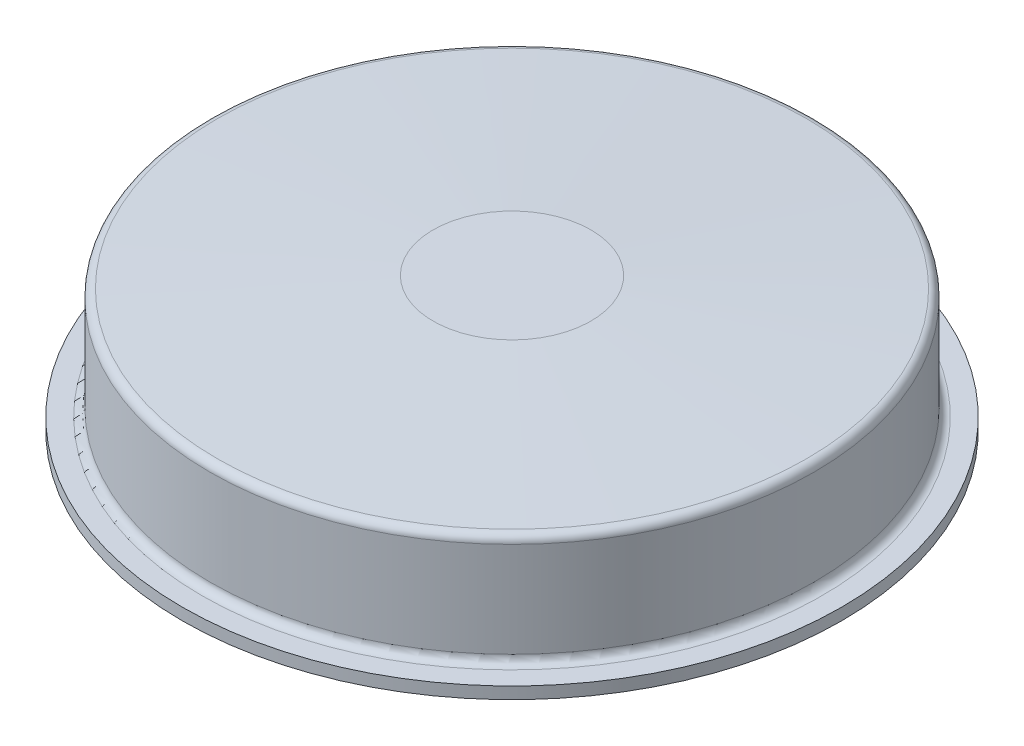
ISO-10303-21;
HEADER;
FILE_DESCRIPTION(('STEP AP214'),'2;1');
FILE_NAME('part.step','',(''),(''),'','','');
FILE_SCHEMA(('AUTOMOTIVE_DESIGN { 1 0 10303 214 1 1 1 1 }'));
ENDSEC;
DATA;
#1=APPLICATION_CONTEXT('core data for automotive mechanical design processes');
#2=APPLICATION_PROTOCOL_DEFINITION('international standard','automotive_design',2000,#1);
#3=PRODUCT_CONTEXT('',#1,'mechanical');
#4=PRODUCT('Part','Part','',(#3));
#5=PRODUCT_RELATED_PRODUCT_CATEGORY('part','',(#4));
#6=PRODUCT_DEFINITION_FORMATION('','',#4);
#7=PRODUCT_DEFINITION_CONTEXT('part definition',#1,'design');
#8=PRODUCT_DEFINITION('design','',#6,#7);
#9=PRODUCT_DEFINITION_SHAPE('','',#8);
#10=(LENGTH_UNIT() NAMED_UNIT(*) SI_UNIT(.MILLI.,.METRE.));
#11=(NAMED_UNIT(*) PLANE_ANGLE_UNIT() SI_UNIT($,.RADIAN.));
#12=(NAMED_UNIT(*) SI_UNIT($,.STERADIAN.) SOLID_ANGLE_UNIT());
#13=UNCERTAINTY_MEASURE_WITH_UNIT(LENGTH_MEASURE(1.E-05),#10,'distance_accuracy_value','');
#14=(GEOMETRIC_REPRESENTATION_CONTEXT(3) GLOBAL_UNCERTAINTY_ASSIGNED_CONTEXT((#13)) GLOBAL_UNIT_ASSIGNED_CONTEXT((#10,
#11,#12)) REPRESENTATION_CONTEXT('',''));
#15=CARTESIAN_POINT('',(0.,0.,0.));
#16=DIRECTION('',(0.,0.,1.));
#17=DIRECTION('',(1.,0.,0.));
#18=AXIS2_PLACEMENT_3D('',#15,#16,#17);
#19=CARTESIAN_POINT('',(600.,1193.5,0.));
#20=DIRECTION('',(0.,-1.,0.));
#21=DIRECTION('',(0.,0.,-1.));
#22=AXIS2_PLACEMENT_3D('',#19,#20,#21);
#23=PLANE('',#22);
#24=CARTESIAN_POINT('',(600.,1193.5,0.));
#25=DIRECTION('',(0.,1.,0.));
#26=DIRECTION('',(0.,0.,1.));
#27=AXIS2_PLACEMENT_3D('',#24,#25,#26);
#28=CIRCLE('',#27,20.);
#29=CARTESIAN_POINT('',(600.,1193.5,-20.0000000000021));
#30=VERTEX_POINT('',#29);
#31=EDGE_CURVE('E10',#30,#30,#28,.T.);
#32=ORIENTED_EDGE('',*,*,#31,.T.);
#33=EDGE_LOOP('',(#32));
#34=FACE_BOUND('',#33,.T.);
#35=ADVANCED_FACE('F29',(#34),#23,.F.);
#36=CARTESIAN_POINT('',(600.,1190.60056396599,0.));
#37=DIRECTION('',(0.,-1.,0.));
#38=DIRECTION('',(0.,0.,-1.));
#39=AXIS2_PLACEMENT_3D('',#36,#37,#38);
#40=CONICAL_SURFACE('',#39,74.606045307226,1.51774879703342);
#41=CARTESIAN_POINT('',(600.,1190.60056396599,0.));
#42=DIRECTION('',(0.,1.,0.));
#43=DIRECTION('',(0.,0.,1.));
#44=AXIS2_PLACEMENT_3D('',#41,#42,#43);
#45=CIRCLE('',#44,74.606045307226);
#46=CARTESIAN_POINT('',(600.,1190.60056396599,-74.6060453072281));
#47=VERTEX_POINT('',#46);
#48=EDGE_CURVE('E35',#47,#47,#45,.T.);
#49=CARTESIAN_POINT('',(600.,1193.5,-20.0000000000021));
#50=CARTESIAN_POINT('',(600.,1193.46979754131,-20.5688129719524));
#51=CARTESIAN_POINT('',(600.,1193.43959508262,-21.1376259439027));
#52=CARTESIAN_POINT('',(600.,1193.37919016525,-22.2752518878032));
#53=CARTESIAN_POINT('',(600.,1193.34898770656,-22.8440648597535));
#54=CARTESIAN_POINT('',(600.,1193.28858278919,-23.981690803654));
#55=CARTESIAN_POINT('',(600.,1193.2583803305,-24.5505037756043));
#56=CARTESIAN_POINT('',(600.,1193.19797541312,-25.6881297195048));
#57=CARTESIAN_POINT('',(600.,1193.16777295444,-26.2569426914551));
#58=CARTESIAN_POINT('',(600.,1193.10736803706,-27.3945686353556));
#59=CARTESIAN_POINT('',(600.,1193.07716557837,-27.9633816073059));
#60=CARTESIAN_POINT('',(600.,1193.016760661,-29.1010075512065));
#61=CARTESIAN_POINT('',(600.,1192.98655820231,-29.6698205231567));
#62=CARTESIAN_POINT('',(600.,1192.92615328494,-30.8074464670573));
#63=CARTESIAN_POINT('',(600.,1192.89595082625,-31.3762594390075));
#64=CARTESIAN_POINT('',(600.,1192.83554590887,-32.5138853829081));
#65=CARTESIAN_POINT('',(600.,1192.80534345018,-33.0826983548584));
#66=CARTESIAN_POINT('',(600.,1192.74493853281,-34.2203242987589));
#67=CARTESIAN_POINT('',(600.,1192.71473607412,-34.7891372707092));
#68=CARTESIAN_POINT('',(600.,1192.65433115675,-35.9267632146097));
#69=CARTESIAN_POINT('',(600.,1192.62412869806,-36.49557618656));
#70=CARTESIAN_POINT('',(600.,1192.56372378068,-37.6332021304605));
#71=CARTESIAN_POINT('',(600.,1192.533521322,-38.2020151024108));
#72=CARTESIAN_POINT('',(600.,1192.47311640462,-39.3396410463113));
#73=CARTESIAN_POINT('',(600.,1192.44291394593,-39.9084540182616));
#74=CARTESIAN_POINT('',(600.,1192.38250902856,-41.0460799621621));
#75=CARTESIAN_POINT('',(600.,1192.35230656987,-41.6148929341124));
#76=CARTESIAN_POINT('',(600.,1192.29190165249,-42.752518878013));
#77=CARTESIAN_POINT('',(600.,1192.26169919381,-43.3213318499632));
#78=CARTESIAN_POINT('',(600.,1192.20129427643,-44.4589577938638));
#79=CARTESIAN_POINT('',(600.,1192.17109181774,-45.027770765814));
#80=CARTESIAN_POINT('',(600.,1192.11068690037,-46.1653967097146));
#81=CARTESIAN_POINT('',(600.,1192.08048444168,-46.7342096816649));
#82=CARTESIAN_POINT('',(600.,1192.02007952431,-47.8718356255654));
#83=CARTESIAN_POINT('',(600.,1191.98987706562,-48.4406485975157));
#84=CARTESIAN_POINT('',(600.,1191.92947214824,-49.5782745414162));
#85=CARTESIAN_POINT('',(600.,1191.89926968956,-50.1470875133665));
#86=CARTESIAN_POINT('',(600.,1191.83886477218,-51.284713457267));
#87=CARTESIAN_POINT('',(600.,1191.80866231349,-51.8535264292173));
#88=CARTESIAN_POINT('',(600.,1191.74825739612,-52.9911523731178));
#89=CARTESIAN_POINT('',(600.,1191.71805493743,-53.5599653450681));
#90=CARTESIAN_POINT('',(600.,1191.65765002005,-54.6975912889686));
#91=CARTESIAN_POINT('',(600.,1191.62744756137,-55.2664042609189));
#92=CARTESIAN_POINT('',(600.,1191.56704264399,-56.4040302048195));
#93=CARTESIAN_POINT('',(600.,1191.5368401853,-56.9728431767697));
#94=CARTESIAN_POINT('',(600.,1191.47643526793,-58.1104691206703));
#95=CARTESIAN_POINT('',(600.,1191.44623280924,-58.6792820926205));
#96=CARTESIAN_POINT('',(600.,1191.38582789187,-59.8169080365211));
#97=CARTESIAN_POINT('',(600.,1191.35562543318,-60.3857210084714));
#98=CARTESIAN_POINT('',(600.,1191.2952205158,-61.5233469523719));
#99=CARTESIAN_POINT('',(600.,1191.26501805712,-62.0921599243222));
#100=CARTESIAN_POINT('',(600.,1191.20461313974,-63.2297858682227));
#101=CARTESIAN_POINT('',(600.,1191.17441068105,-63.798598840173));
#102=CARTESIAN_POINT('',(600.,1191.11400576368,-64.9362247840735));
#103=CARTESIAN_POINT('',(600.,1191.08380330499,-65.5050377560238));
#104=CARTESIAN_POINT('',(600.,1191.02339838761,-66.6426636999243));
#105=CARTESIAN_POINT('',(600.,1190.99319592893,-67.2114766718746));
#106=CARTESIAN_POINT('',(600.,1190.93279101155,-68.3491026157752));
#107=CARTESIAN_POINT('',(600.,1190.90258855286,-68.9179155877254));
#108=CARTESIAN_POINT('',(600.,1190.84218363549,-70.055541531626));
#109=CARTESIAN_POINT('',(600.,1190.8119811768,-70.6243545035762));
#110=CARTESIAN_POINT('',(600.,1190.75157625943,-71.7619804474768));
#111=CARTESIAN_POINT('',(600.,1190.72137380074,-72.330793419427));
#112=CARTESIAN_POINT('',(600.,1190.66096888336,-73.4684193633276));
#113=CARTESIAN_POINT('',(600.,1190.63076642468,-74.0372323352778));
#114=CARTESIAN_POINT('',(600.,1190.60056396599,-74.6060453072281));
#115=B_SPLINE_CURVE_WITH_KNOTS('',3,(#49,#50,#51,#52,#53,#54,#55,#56,#57,#58,#59,#60,#61,#62,
#63,#64,#65,#66,#67,#68,#69,#70,#71,#72,#73,#74,#75,#76,#77,#78,#79,#80,#81,#82,#83,#84,#85,#86,
#87,#88,#89,#90,#91,#92,#93,#94,#95,#96,#97,#98,#99,#100,#101,#102,#103,#104,#105,#106,#107,
#108,#109,#110,#111,#112,#113,#114),.UNSPECIFIED.,.F.,.F.,(4,2,2,2,2,2,2,2,2,2,2,2,2,2,2,2,2,2,
2,2,2,2,2,2,2,2,2,2,2,2,2,2,4),(0.,1.70884272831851,3.41768545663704,5.12652818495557,
6.83537091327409,8.54421364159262,10.2530563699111,11.9618990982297,13.6707418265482,
15.3795845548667,17.0884272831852,18.7972700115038,20.5061127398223,22.2149554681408,
23.9237981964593,25.6326409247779,27.3414836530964,29.0503263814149,30.7591691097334,
32.4680118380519,34.1768545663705,35.885697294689,37.5945400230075,39.303382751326,
41.0122254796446,42.7210682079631,44.4299109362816,46.1387536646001,47.8475963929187,
49.5564391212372,51.2652818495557,52.9741245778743,54.6829673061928),.UNSPECIFIED.);
#116=EDGE_CURVE('BSEAM76',#30,#47,#115,.T.);
#117=ORIENTED_EDGE('',*,*,#31,.F.);
#118=ORIENTED_EDGE('',*,*,#48,.T.);
#119=ORIENTED_EDGE('',*,*,#116,.T.);
#120=ORIENTED_EDGE('',*,*,#116,.F.);
#121=EDGE_LOOP('',(#117,#119,#118,#120));
#122=FACE_BOUND('',#121,.T.);
#123=ADVANCED_FACE('F76',(#122),#40,.T.);
#124=CARTESIAN_POINT('',(600.,1188.60337734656,0.));
#125=DIRECTION('',(0.,1.,0.));
#126=DIRECTION('',(0.,0.,1.));
#127=AXIS2_PLACEMENT_3D('',#124,#125,#126);
#128=TOROIDAL_SURFACE('',#127,74.4999999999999,1.99999999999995);
#129=ORIENTED_EDGE('',*,*,#48,.F.);
#130=EDGE_LOOP('',(#129));
#131=FACE_BOUND('',#130,.T.);
#132=CARTESIAN_POINT('',(600.,1188.60337734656,0.));
#133=DIRECTION('',(0.,1.,0.));
#134=DIRECTION('',(0.,0.,1.));
#135=AXIS2_PLACEMENT_3D('',#132,#133,#134);
#136=CIRCLE('',#135,76.4999999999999);
#137=CARTESIAN_POINT('',(600.,1188.60337734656,76.4999999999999));
#138=VERTEX_POINT('',#137);
#139=EDGE_CURVE('E39',#138,#138,#136,.T.);
#140=ORIENTED_EDGE('',*,*,#139,.T.);
#141=EDGE_LOOP('',(#140));
#142=FACE_BOUND('',#141,.T.);
#143=ADVANCED_FACE('F80',(#131,#142),#128,.T.);
#144=CARTESIAN_POINT('',(600.,1187.5,0.));
#145=DIRECTION('',(0.,1.,0.));
#146=DIRECTION('',(0.,0.,1.));
#147=AXIS2_PLACEMENT_3D('',#144,#145,#146);
#148=CYLINDRICAL_SURFACE('',#147,76.5);
#149=ORIENTED_EDGE('',*,*,#139,.F.);
#150=EDGE_LOOP('',(#149));
#151=FACE_BOUND('',#150,.T.);
#152=CARTESIAN_POINT('',(600.,1164.5,0.));
#153=DIRECTION('',(0.,1.,0.));
#154=DIRECTION('',(0.,0.,1.));
#155=AXIS2_PLACEMENT_3D('',#152,#153,#154);
#156=CIRCLE('',#155,76.5);
#157=CARTESIAN_POINT('',(600.,1164.5,76.5));
#158=VERTEX_POINT('',#157);
#159=EDGE_CURVE('E43',#158,#158,#156,.T.);
#160=ORIENTED_EDGE('',*,*,#159,.T.);
#161=EDGE_LOOP('',(#160));
#162=FACE_BOUND('',#161,.T.);
#163=ADVANCED_FACE('F85',(#151,#162),#148,.T.);
#164=CARTESIAN_POINT('',(600.,1164.5,0.));
#165=DIRECTION('',(0.,1.,0.));
#166=DIRECTION('',(0.,0.,1.));
#167=AXIS2_PLACEMENT_3D('',#164,#165,#166);
#168=TOROIDAL_SURFACE('',#167,78.5,2.);
#169=ORIENTED_EDGE('',*,*,#159,.F.);
#170=EDGE_LOOP('',(#169));
#171=FACE_BOUND('',#170,.T.);
#172=CARTESIAN_POINT('',(600.,1162.5,0.));
#173=DIRECTION('',(0.,1.,0.));
#174=DIRECTION('',(0.,0.,1.));
#175=AXIS2_PLACEMENT_3D('',#172,#173,#174);
#176=CIRCLE('',#175,78.5);
#177=CARTESIAN_POINT('',(600.,1162.5,78.5));
#178=VERTEX_POINT('',#177);
#179=EDGE_CURVE('E48',#178,#178,#176,.T.);
#180=ORIENTED_EDGE('',*,*,#179,.T.);
#181=EDGE_LOOP('',(#180));
#182=FACE_BOUND('',#181,.T.);
#183=ADVANCED_FACE('F91',(#171,#182),#168,.F.);
#184=CARTESIAN_POINT('',(678.5,1162.5,0.));
#185=DIRECTION('',(0.,-1.,0.));
#186=DIRECTION('',(0.,0.,-1.));
#187=AXIS2_PLACEMENT_3D('',#184,#185,#186);
#188=PLANE('',#187);
#189=ORIENTED_EDGE('',*,*,#179,.F.);
#190=EDGE_LOOP('',(#189));
#191=FACE_BOUND('',#190,.T.);
#192=CARTESIAN_POINT('',(600.,1162.5,0.));
#193=DIRECTION('',(0.,1.,0.));
#194=DIRECTION('',(0.,0.,1.));
#195=AXIS2_PLACEMENT_3D('',#192,#193,#194);
#196=CIRCLE('',#195,83.5);
#197=CARTESIAN_POINT('',(600.,1162.5,83.5));
#198=VERTEX_POINT('',#197);
#199=EDGE_CURVE('E51',#198,#198,#196,.T.);
#200=ORIENTED_EDGE('',*,*,#199,.T.);
#201=EDGE_LOOP('',(#200));
#202=FACE_BOUND('',#201,.T.);
#203=ADVANCED_FACE('F95',(#191,#202),#188,.F.);
#204=CARTESIAN_POINT('',(600.,1187.5,0.));
#205=DIRECTION('',(0.,1.,0.));
#206=DIRECTION('',(0.,0.,1.));
#207=AXIS2_PLACEMENT_3D('',#204,#205,#206);
#208=CYLINDRICAL_SURFACE('',#207,83.5);
#209=ORIENTED_EDGE('',*,*,#199,.F.);
#210=EDGE_LOOP('',(#209));
#211=FACE_BOUND('',#210,.T.);
#212=CARTESIAN_POINT('',(600.,1159.5,0.));
#213=DIRECTION('',(0.,1.,0.));
#214=DIRECTION('',(0.,0.,1.));
#215=AXIS2_PLACEMENT_3D('',#212,#213,#214);
#216=CIRCLE('',#215,83.5);
#217=CARTESIAN_POINT('',(600.,1159.5,83.5));
#218=VERTEX_POINT('',#217);
#219=EDGE_CURVE('E54',#218,#218,#216,.T.);
#220=ORIENTED_EDGE('',*,*,#219,.T.);
#221=EDGE_LOOP('',(#220));
#222=FACE_BOUND('',#221,.T.);
#223=ADVANCED_FACE('F99',(#211,#222),#208,.T.);
#224=CARTESIAN_POINT('',(673.5,1159.5,0.));
#225=DIRECTION('',(0.,1.,0.));
#226=DIRECTION('',(0.,0.,1.));
#227=AXIS2_PLACEMENT_3D('',#224,#225,#226);
#228=PLANE('',#227);
#229=ORIENTED_EDGE('',*,*,#219,.F.);
#230=EDGE_LOOP('',(#229));
#231=FACE_BOUND('',#230,.T.);
#232=CARTESIAN_POINT('',(600.,1159.5,0.));
#233=DIRECTION('',(0.,1.,0.));
#234=DIRECTION('',(0.,0.,1.));
#235=AXIS2_PLACEMENT_3D('',#232,#233,#234);
#236=CIRCLE('',#235,73.5);
#237=CARTESIAN_POINT('',(600.,1159.5,73.5));
#238=VERTEX_POINT('',#237);
#239=EDGE_CURVE('E57',#238,#238,#236,.T.);
#240=ORIENTED_EDGE('',*,*,#239,.T.);
#241=EDGE_LOOP('',(#240));
#242=FACE_BOUND('',#241,.T.);
#243=ADVANCED_FACE('F72',(#231,#242),#228,.F.);
#244=CARTESIAN_POINT('',(600.,1187.5,0.));
#245=DIRECTION('',(0.,1.,0.));
#246=DIRECTION('',(0.,0.,1.));
#247=AXIS2_PLACEMENT_3D('',#244,#245,#246);
#248=CYLINDRICAL_SURFACE('',#247,73.5);
#249=ORIENTED_EDGE('',*,*,#239,.F.);
#250=EDGE_LOOP('',(#249));
#251=FACE_BOUND('',#250,.T.);
#252=CARTESIAN_POINT('',(600.,1187.5,0.));
#253=DIRECTION('',(0.,1.,0.));
#254=DIRECTION('',(0.,0.,1.));
#255=AXIS2_PLACEMENT_3D('',#252,#253,#254);
#256=CIRCLE('',#255,73.5);
#257=CARTESIAN_POINT('',(600.,1187.5,73.5));
#258=VERTEX_POINT('',#257);
#259=EDGE_CURVE('E60',#258,#258,#256,.T.);
#260=ORIENTED_EDGE('',*,*,#259,.T.);
#261=EDGE_LOOP('',(#260));
#262=FACE_BOUND('',#261,.T.);
#263=ADVANCED_FACE('F64',(#251,#262),#248,.F.);
#264=CARTESIAN_POINT('',(600.,1187.5,0.));
#265=DIRECTION('',(0.,1.,0.));
#266=DIRECTION('',(0.,0.,1.));
#267=AXIS2_PLACEMENT_3D('',#264,#265,#266);
#268=PLANE('',#267);
#269=ORIENTED_EDGE('',*,*,#259,.F.);
#270=EDGE_LOOP('',(#269));
#271=FACE_BOUND('',#270,.T.);
#272=ADVANCED_FACE('F66',(#271),#268,.F.);
#273=CLOSED_SHELL('',(#35,#123,#143,#163,#183,#203,#223,#243,#263,#272));
#274=MANIFOLD_SOLID_BREP('B2',#273);
#275=ADVANCED_BREP_SHAPE_REPRESENTATION('',(#18,#274),#14);
#276=SHAPE_DEFINITION_REPRESENTATION(#9,#275);
ENDSEC;
END-ISO-10303-21;
